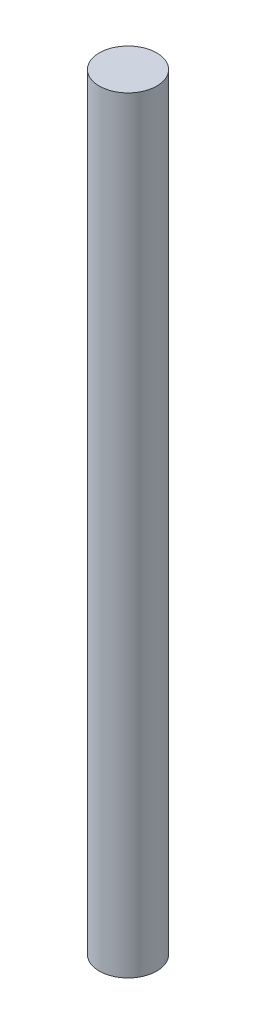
ISO-10303-21;
HEADER;
FILE_DESCRIPTION(('STEP AP214'),'2;1');
FILE_NAME('part.step','',(''),(''),'','','');
FILE_SCHEMA(('AUTOMOTIVE_DESIGN { 1 0 10303 214 1 1 1 1 }'));
ENDSEC;
DATA;
#1=APPLICATION_CONTEXT('core data for automotive mechanical design processes');
#2=APPLICATION_PROTOCOL_DEFINITION('international standard','automotive_design',2000,#1);
#3=PRODUCT_CONTEXT('',#1,'mechanical');
#4=PRODUCT('Part','Part','',(#3));
#5=PRODUCT_RELATED_PRODUCT_CATEGORY('part','',(#4));
#6=PRODUCT_DEFINITION_FORMATION('','',#4);
#7=PRODUCT_DEFINITION_CONTEXT('part definition',#1,'design');
#8=PRODUCT_DEFINITION('design','',#6,#7);
#9=PRODUCT_DEFINITION_SHAPE('','',#8);
#10=(LENGTH_UNIT() NAMED_UNIT(*) SI_UNIT(.MILLI.,.METRE.));
#11=(NAMED_UNIT(*) PLANE_ANGLE_UNIT() SI_UNIT($,.RADIAN.));
#12=(NAMED_UNIT(*) SI_UNIT($,.STERADIAN.) SOLID_ANGLE_UNIT());
#13=UNCERTAINTY_MEASURE_WITH_UNIT(LENGTH_MEASURE(1.E-05),#10,'distance_accuracy_value','');
#14=(GEOMETRIC_REPRESENTATION_CONTEXT(3) GLOBAL_UNCERTAINTY_ASSIGNED_CONTEXT((#13)) GLOBAL_UNIT_ASSIGNED_CONTEXT((#10,
#11,#12)) REPRESENTATION_CONTEXT('',''));
#15=CARTESIAN_POINT('',(0.,0.,0.));
#16=DIRECTION('',(0.,0.,1.));
#17=DIRECTION('',(1.,0.,0.));
#18=AXIS2_PLACEMENT_3D('',#15,#16,#17);
#19=CARTESIAN_POINT('',(0.,15.0000000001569,0.));
#20=DIRECTION('',(0.,-1.,0.));
#21=DIRECTION('',(0.,0.,-1.));
#22=AXIS2_PLACEMENT_3D('',#19,#20,#21);
#23=CONICAL_SURFACE('',#22,2.49999999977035,1.02974425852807);
#24=CARTESIAN_POINT('',(0.,16.5021515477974,8.5265128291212E-11));
#25=VERTEX_POINT('',#24);
#26=VERTEX_LOOP('',#25);
#27=FACE_BOUND('',#26,.T.);
#28=CARTESIAN_POINT('',(0.,15.,0.));
#29=DIRECTION('',(0.,-1.,0.));
#30=DIRECTION('',(0.,0.,-1.));
#31=AXIS2_PLACEMENT_3D('',#28,#29,#30);
#32=CIRCLE('',#31,2.5);
#33=CARTESIAN_POINT('',(0.,15.,-2.5));
#34=VERTEX_POINT('',#33);
#35=EDGE_CURVE('E33',#34,#34,#32,.T.);
#36=ORIENTED_EDGE('',*,*,#35,.T.);
#37=EDGE_LOOP('',(#36));
#38=FACE_BOUND('',#37,.T.);
#39=ADVANCED_FACE('F17',(#27,#38),#23,.F.);
#40=CARTESIAN_POINT('',(0.,0.,0.));
#41=DIRECTION('',(0.,-1.,0.));
#42=DIRECTION('',(0.,0.,-1.));
#43=AXIS2_PLACEMENT_3D('',#40,#41,#42);
#44=CYLINDRICAL_SURFACE('',#43,2.5);
#45=ORIENTED_EDGE('',*,*,#35,.F.);
#46=EDGE_LOOP('',(#45));
#47=FACE_BOUND('',#46,.T.);
#48=CARTESIAN_POINT('',(0.,0.,0.));
#49=DIRECTION('',(0.,-1.,0.));
#50=DIRECTION('',(0.,0.,-1.));
#51=AXIS2_PLACEMENT_3D('',#48,#49,#50);
#52=CIRCLE('',#51,2.5);
#53=CARTESIAN_POINT('',(0.,0.,-2.5));
#54=VERTEX_POINT('',#53);
#55=EDGE_CURVE('E20',#54,#54,#52,.T.);
#56=ORIENTED_EDGE('',*,*,#55,.T.);
#57=EDGE_LOOP('',(#56));
#58=FACE_BOUND('',#57,.T.);
#59=ADVANCED_FACE('F30',(#47,#58),#44,.F.);
#60=CARTESIAN_POINT('',(0.,160.,0.));
#61=DIRECTION('',(0.,1.,0.));
#62=DIRECTION('',(0.,0.,1.));
#63=AXIS2_PLACEMENT_3D('',#60,#61,#62);
#64=PLANE('',#63);
#65=CARTESIAN_POINT('',(0.,160.,0.));
#66=DIRECTION('',(0.,-1.,0.));
#67=DIRECTION('',(0.,0.,-1.));
#68=AXIS2_PLACEMENT_3D('',#65,#66,#67);
#69=CIRCLE('',#68,6.);
#70=CARTESIAN_POINT('',(0.,160.,-6.));
#71=VERTEX_POINT('',#70);
#72=EDGE_CURVE('E24',#71,#71,#69,.T.);
#73=ORIENTED_EDGE('',*,*,#72,.F.);
#74=EDGE_LOOP('',(#73));
#75=FACE_BOUND('',#74,.T.);
#76=ADVANCED_FACE('F42',(#75),#64,.T.);
#77=CARTESIAN_POINT('',(0.,0.,0.));
#78=DIRECTION('',(0.,1.,0.));
#79=DIRECTION('',(0.,0.,1.));
#80=AXIS2_PLACEMENT_3D('',#77,#78,#79);
#81=PLANE('',#80);
#82=CARTESIAN_POINT('',(0.,0.,0.));
#83=DIRECTION('',(0.,-1.,0.));
#84=DIRECTION('',(0.,0.,-1.));
#85=AXIS2_PLACEMENT_3D('',#82,#83,#84);
#86=CIRCLE('',#85,6.);
#87=CARTESIAN_POINT('',(0.,0.,-6.));
#88=VERTEX_POINT('',#87);
#89=EDGE_CURVE('E11',#88,#88,#86,.F.);
#90=ORIENTED_EDGE('',*,*,#89,.F.);
#91=EDGE_LOOP('',(#90));
#92=FACE_BOUND('',#91,.T.);
#93=ORIENTED_EDGE('',*,*,#55,.F.);
#94=EDGE_LOOP('',(#93));
#95=FACE_BOUND('',#94,.T.);
#96=ADVANCED_FACE('F44',(#92,#95),#81,.F.);
#97=CARTESIAN_POINT('',(0.,160.,0.));
#98=DIRECTION('',(0.,-1.,0.));
#99=DIRECTION('',(0.,0.,-1.));
#100=AXIS2_PLACEMENT_3D('',#97,#98,#99);
#101=CYLINDRICAL_SURFACE('',#100,6.);
#102=ORIENTED_EDGE('',*,*,#89,.T.);
#103=EDGE_LOOP('',(#102));
#104=FACE_BOUND('',#103,.T.);
#105=ORIENTED_EDGE('',*,*,#72,.T.);
#106=EDGE_LOOP('',(#105));
#107=FACE_BOUND('',#106,.T.);
#108=ADVANCED_FACE('F40',(#104,#107),#101,.T.);
#109=CLOSED_SHELL('',(#39,#59,#76,#96,#108));
#110=MANIFOLD_SOLID_BREP('B1',#109);
#111=ADVANCED_BREP_SHAPE_REPRESENTATION('',(#18,#110),#14);
#112=SHAPE_DEFINITION_REPRESENTATION(#9,#111);
ENDSEC;
END-ISO-10303-21;
